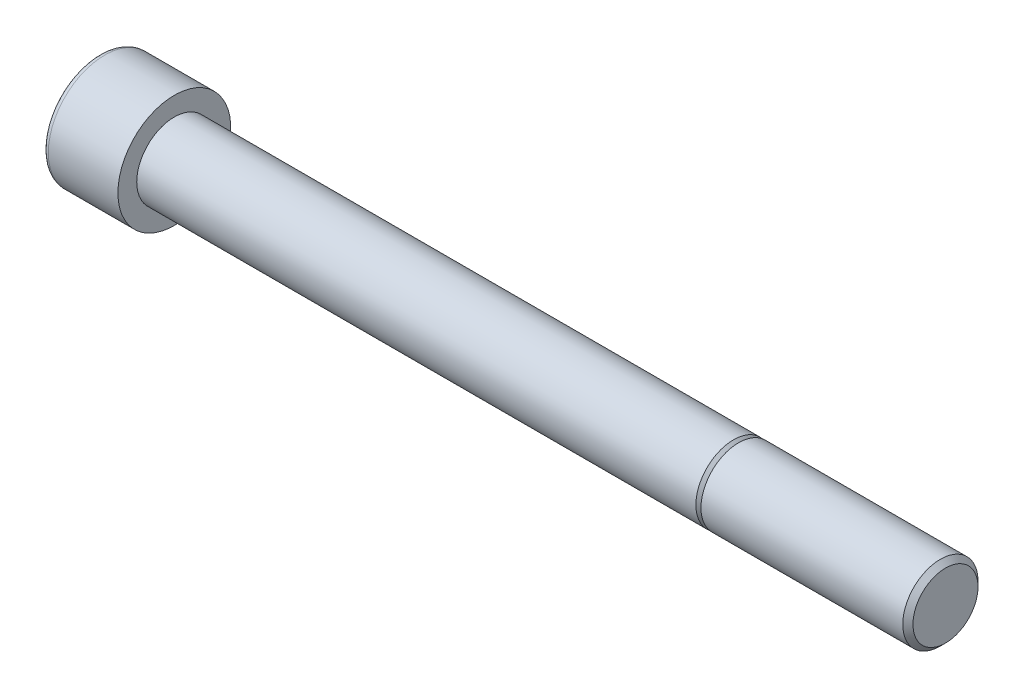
from build123d import *

# Parameters (mm, degrees)
ENL_V_MAT_EXTRU_1_DEPTH = 8
CHANFREIN1_SIZE         = 1.0825
CONG_1_R                = 1.2


with BuildPart() as part:
    # Esquisse1 → R_volution1 (revolve)
    with BuildSketch(Plane(origin=(0, 0, 0), x_dir=(-1, 0, 0), z_dir=(0, 0, -1)), mode=Mode.PRIVATE) as r_volution1_sk:
        Polygon((-80, 8), (-80, 0), (100, 0), (100, 12), (84, 12), (84, 8), (-34.9175, 8), (-36, 6.9175), (-36, 8), align=None)
    revolve(r_volution1_sk.sketch.rotate(Axis((80, 0, 0), (-1, 0, 0)), 270), axis=Axis((80, 0, 0), (-1, 0, 0)))

    # Esquisse2 → Enl_v. mat.-Extru.1 (cut)
    with BuildSketch(Plane.ZY.offset(100)):
        Polygon((-7, -4.041451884), (0, -8.082903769), (7, -4.041451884), (7, 4.041451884), (0, 8.082903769), (-7, 4.041451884), align=None)
    extrude(amount=-ENL_V_MAT_EXTRU_1_DEPTH, mode=Mode.SUBTRACT)

    # Chanfrein1
    chanfrein1_edges = [part.edges().sort_by_distance(p)[0] for p in [
        (80, 0, -8),
    ]]
    chamfer(chanfrein1_edges, length=CHANFREIN1_SIZE)

    # Cong_1
    cong_1_edges = [part.edges().sort_by_distance(p)[0] for p in [
        (-100, 0, -12),
    ]]
    fillet(cong_1_edges, radius=CONG_1_R)


solid = part.part
